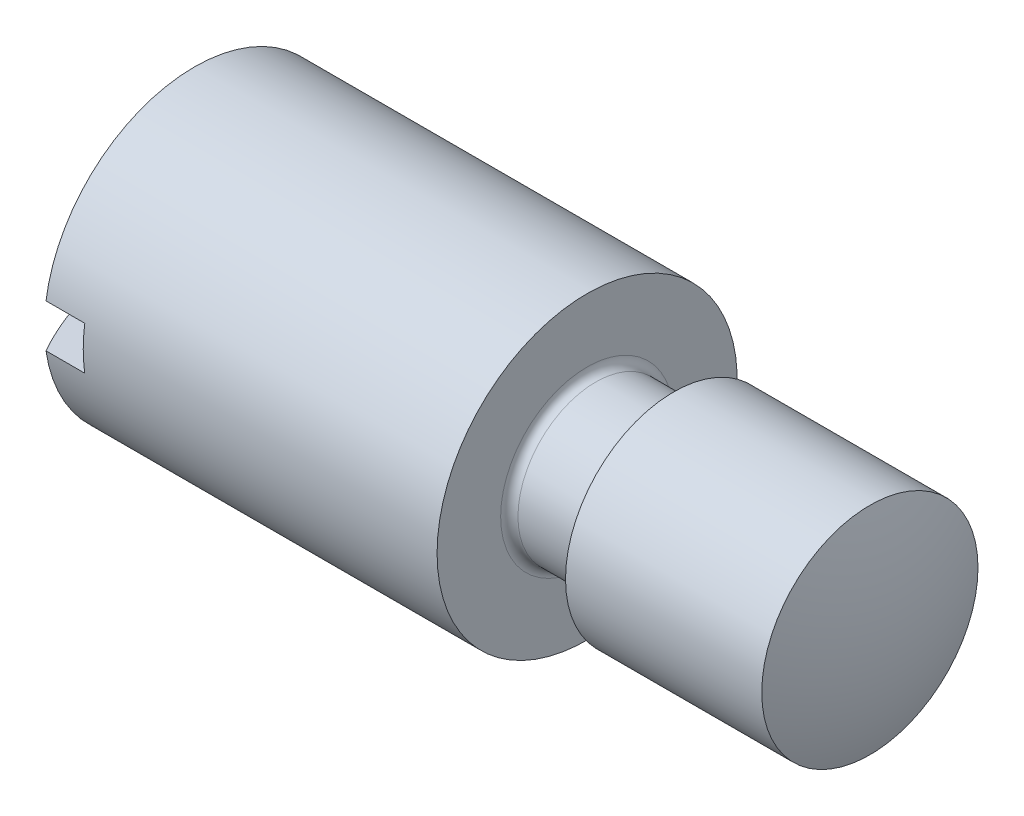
ISO-10303-21;
HEADER;
FILE_DESCRIPTION(('STEP AP214'),'2;1');
FILE_NAME('part.step','',(''),(''),'','','');
FILE_SCHEMA(('AUTOMOTIVE_DESIGN { 1 0 10303 214 1 1 1 1 }'));
ENDSEC;
DATA;
#1=APPLICATION_CONTEXT('core data for automotive mechanical design processes');
#2=APPLICATION_PROTOCOL_DEFINITION('international standard','automotive_design',2000,#1);
#3=PRODUCT_CONTEXT('',#1,'mechanical');
#4=PRODUCT('Part','Part','',(#3));
#5=PRODUCT_RELATED_PRODUCT_CATEGORY('part','',(#4));
#6=PRODUCT_DEFINITION_FORMATION('','',#4);
#7=PRODUCT_DEFINITION_CONTEXT('part definition',#1,'design');
#8=PRODUCT_DEFINITION('design','',#6,#7);
#9=PRODUCT_DEFINITION_SHAPE('','',#8);
#10=(LENGTH_UNIT() NAMED_UNIT(*) SI_UNIT(.MILLI.,.METRE.));
#11=(NAMED_UNIT(*) PLANE_ANGLE_UNIT() SI_UNIT($,.RADIAN.));
#12=(NAMED_UNIT(*) SI_UNIT($,.STERADIAN.) SOLID_ANGLE_UNIT());
#13=UNCERTAINTY_MEASURE_WITH_UNIT(LENGTH_MEASURE(1.E-05),#10,'distance_accuracy_value','');
#14=(GEOMETRIC_REPRESENTATION_CONTEXT(3) GLOBAL_UNCERTAINTY_ASSIGNED_CONTEXT((#13)) GLOBAL_UNIT_ASSIGNED_CONTEXT((#10,
#11,#12)) REPRESENTATION_CONTEXT('',''));
#15=CARTESIAN_POINT('',(0.,0.,0.));
#16=DIRECTION('',(0.,0.,1.));
#17=DIRECTION('',(1.,0.,0.));
#18=AXIS2_PLACEMENT_3D('',#15,#16,#17);
#19=CARTESIAN_POINT('',(3.5,0.,0.));
#20=DIRECTION('',(-1.,0.,0.));
#21=DIRECTION('',(0.,0.,-1.));
#22=AXIS2_PLACEMENT_3D('',#19,#20,#21);
#23=SPHERICAL_SURFACE('',#22,3.5);
#24=CARTESIAN_POINT('',(0.460300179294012,0.,0.));
#25=DIRECTION('',(-1.,0.,0.));
#26=DIRECTION('',(0.,0.,1.));
#27=AXIS2_PLACEMENT_3D('',#24,#25,#26);
#28=CIRCLE('',#27,1.735);
#29=CARTESIAN_POINT('',(0.460300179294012,-0.250000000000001,-1.71689399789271));
#30=VERTEX_POINT('',#29);
#31=CARTESIAN_POINT('',(0.460300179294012,-0.250000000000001,1.71689399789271));
#32=VERTEX_POINT('',#31);
#33=EDGE_CURVE('E118',#30,#32,#28,.T.);
#34=ORIENTED_EDGE('',*,*,#33,.T.);
#35=CARTESIAN_POINT('',(3.5,-0.250000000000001,0.));
#36=DIRECTION('',(0.,-1.,0.));
#37=DIRECTION('',(0.,0.,-1.));
#38=AXIS2_PLACEMENT_3D('',#35,#36,#37);
#39=CIRCLE('',#38,3.49106001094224);
#40=EDGE_CURVE('E60',#32,#30,#39,.T.);
#41=ORIENTED_EDGE('',*,*,#40,.T.);
#42=EDGE_LOOP('',(#34,#41));
#43=FACE_BOUND('',#42,.T.);
#44=ADVANCED_FACE('F37',(#43),#23,.T.);
#45=CARTESIAN_POINT('',(0.460300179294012,0.249999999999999,1.71689399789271));
#46=VERTEX_POINT('',#45);
#47=CARTESIAN_POINT('',(0.460300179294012,0.249999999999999,-1.71689399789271));
#48=VERTEX_POINT('',#47);
#49=EDGE_CURVE('E117',#46,#48,#28,.T.);
#50=ORIENTED_EDGE('',*,*,#49,.T.);
#51=CARTESIAN_POINT('',(3.5,0.249999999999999,0.));
#52=DIRECTION('',(0.,1.,0.));
#53=DIRECTION('',(0.,0.,1.));
#54=AXIS2_PLACEMENT_3D('',#51,#52,#53);
#55=CIRCLE('',#54,3.49106001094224);
#56=EDGE_CURVE('E84',#48,#46,#55,.T.);
#57=ORIENTED_EDGE('',*,*,#56,.T.);
#58=EDGE_LOOP('',(#50,#57));
#59=FACE_BOUND('',#58,.T.);
#60=ADVANCED_FACE('F126',(#59),#23,.T.);
#61=CARTESIAN_POINT('',(5.,0.,0.));
#62=DIRECTION('',(-1.,0.,0.));
#63=DIRECTION('',(0.,0.,-1.));
#64=AXIS2_PLACEMENT_3D('',#61,#62,#63);
#65=SPHERICAL_SURFACE('',#64,3.5);
#66=CARTESIAN_POINT('',(8.2691742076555,0.,0.));
#67=DIRECTION('',(-1.,0.,0.));
#68=DIRECTION('',(0.,0.,1.));
#69=AXIS2_PLACEMENT_3D('',#66,#67,#68);
#70=CIRCLE('',#69,1.25);
#71=CARTESIAN_POINT('',(8.2691742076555,0.,1.25));
#72=VERTEX_POINT('',#71);
#73=EDGE_CURVE('E105',#72,#72,#70,.T.);
#74=ORIENTED_EDGE('',*,*,#73,.F.);
#75=EDGE_LOOP('',(#74));
#76=FACE_BOUND('',#75,.T.);
#77=ADVANCED_FACE('F131',(#76),#65,.T.);
#78=CARTESIAN_POINT('',(-4.49873518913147,0.,0.));
#79=DIRECTION('',(-1.,0.,0.));
#80=DIRECTION('',(0.,0.,1.));
#81=AXIS2_PLACEMENT_3D('',#78,#79,#80);
#82=CYLINDRICAL_SURFACE('',#81,1.25);
#83=CARTESIAN_POINT('',(6.,0.,0.));
#84=DIRECTION('',(-1.,0.,0.));
#85=DIRECTION('',(0.,0.,1.));
#86=AXIS2_PLACEMENT_3D('',#83,#84,#85);
#87=CIRCLE('',#86,1.25);
#88=CARTESIAN_POINT('',(6.,0.,1.25));
#89=VERTEX_POINT('',#88);
#90=EDGE_CURVE('E107',#89,#89,#87,.T.);
#91=ORIENTED_EDGE('',*,*,#90,.F.);
#92=EDGE_LOOP('',(#91));
#93=FACE_BOUND('',#92,.T.);
#94=ORIENTED_EDGE('',*,*,#73,.T.);
#95=EDGE_LOOP('',(#94));
#96=FACE_BOUND('',#95,.T.);
#97=ADVANCED_FACE('F179',(#93,#96),#82,.T.);
#98=CARTESIAN_POINT('',(6.,0.,-1.25));
#99=DIRECTION('',(1.,0.,0.));
#100=DIRECTION('',(0.,0.,-1.));
#101=AXIS2_PLACEMENT_3D('',#98,#99,#100);
#102=PLANE('',#101);
#103=CARTESIAN_POINT('',(6.,0.,0.));
#104=DIRECTION('',(1.,0.,0.));
#105=DIRECTION('',(0.,0.,-1.));
#106=AXIS2_PLACEMENT_3D('',#103,#104,#105);
#107=CIRCLE('',#106,1.);
#108=CARTESIAN_POINT('',(6.,0.,-1.));
#109=VERTEX_POINT('',#108);
#110=EDGE_CURVE('E45',#109,#109,#107,.T.);
#111=ORIENTED_EDGE('',*,*,#110,.T.);
#112=EDGE_LOOP('',(#111));
#113=FACE_BOUND('',#112,.T.);
#114=ORIENTED_EDGE('',*,*,#90,.T.);
#115=EDGE_LOOP('',(#114));
#116=FACE_BOUND('',#115,.T.);
#117=ADVANCED_FACE('F177',(#113,#116),#102,.F.);
#118=CARTESIAN_POINT('',(-4.49873518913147,0.,0.));
#119=DIRECTION('',(-1.,0.,0.));
#120=DIRECTION('',(0.,0.,1.));
#121=AXIS2_PLACEMENT_3D('',#118,#119,#120);
#122=CYLINDRICAL_SURFACE('',#121,0.9);
#123=CARTESIAN_POINT('',(5.9,0.,0.));
#124=DIRECTION('',(1.,0.,0.));
#125=DIRECTION('',(0.,0.,-1.));
#126=AXIS2_PLACEMENT_3D('',#123,#124,#125);
#127=CIRCLE('',#126,0.9);
#128=CARTESIAN_POINT('',(5.9,0.,-0.9));
#129=VERTEX_POINT('',#128);
#130=EDGE_CURVE('E149',#129,#129,#127,.F.);
#131=ORIENTED_EDGE('',*,*,#130,.T.);
#132=EDGE_LOOP('',(#131));
#133=FACE_BOUND('',#132,.T.);
#134=CARTESIAN_POINT('',(5.1,0.,0.));
#135=DIRECTION('',(-1.,0.,0.));
#136=DIRECTION('',(0.,0.,1.));
#137=AXIS2_PLACEMENT_3D('',#134,#135,#136);
#138=CIRCLE('',#137,0.9);
#139=CARTESIAN_POINT('',(5.1,0.,0.9));
#140=VERTEX_POINT('',#139);
#141=EDGE_CURVE('E151',#140,#140,#138,.F.);
#142=ORIENTED_EDGE('',*,*,#141,.T.);
#143=EDGE_LOOP('',(#142));
#144=FACE_BOUND('',#143,.T.);
#145=ADVANCED_FACE('F159',(#133,#144),#122,.T.);
#146=CARTESIAN_POINT('',(5.,0.,-0.9));
#147=DIRECTION('',(-1.,0.,0.));
#148=DIRECTION('',(0.,0.,1.));
#149=AXIS2_PLACEMENT_3D('',#146,#147,#148);
#150=PLANE('',#149);
#151=CARTESIAN_POINT('',(5.,0.,0.));
#152=DIRECTION('',(-1.,0.,0.));
#153=DIRECTION('',(0.,0.,1.));
#154=AXIS2_PLACEMENT_3D('',#151,#152,#153);
#155=CIRCLE('',#154,1.);
#156=CARTESIAN_POINT('',(5.,0.,1.));
#157=VERTEX_POINT('',#156);
#158=EDGE_CURVE('E11',#157,#157,#155,.T.);
#159=ORIENTED_EDGE('',*,*,#158,.T.);
#160=EDGE_LOOP('',(#159));
#161=FACE_BOUND('',#160,.T.);
#162=CARTESIAN_POINT('',(5.,0.,0.));
#163=DIRECTION('',(-1.,0.,0.));
#164=DIRECTION('',(0.,0.,1.));
#165=AXIS2_PLACEMENT_3D('',#162,#163,#164);
#166=CIRCLE('',#165,1.735);
#167=CARTESIAN_POINT('',(5.,0.,1.735));
#168=VERTEX_POINT('',#167);
#169=EDGE_CURVE('E111',#168,#168,#166,.T.);
#170=ORIENTED_EDGE('',*,*,#169,.F.);
#171=EDGE_LOOP('',(#170));
#172=FACE_BOUND('',#171,.T.);
#173=ADVANCED_FACE('F163',(#161,#172),#150,.F.);
#174=CARTESIAN_POINT('',(-4.49873518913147,0.,0.));
#175=DIRECTION('',(-1.,0.,0.));
#176=DIRECTION('',(0.,0.,1.));
#177=AXIS2_PLACEMENT_3D('',#174,#175,#176);
#178=CYLINDRICAL_SURFACE('',#177,1.735);
#179=DIRECTION('',(-1.,0.,0.));
#180=VECTOR('',#179,1.);
#181=CARTESIAN_POINT('',(-4.49873518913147,-0.250000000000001,-1.71689399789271));
#182=LINE('',#181,#180);
#183=CARTESIAN_POINT('',(0.90893985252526,-0.250000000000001,-1.71689399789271));
#184=VERTEX_POINT('',#183);
#185=EDGE_CURVE('E100',#30,#184,#182,.F.);
#186=ORIENTED_EDGE('',*,*,#185,.T.);
#187=CARTESIAN_POINT('',(0.90893985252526,0.,0.));
#188=DIRECTION('',(1.,0.,0.));
#189=DIRECTION('',(0.,1.,0.));
#190=AXIS2_PLACEMENT_3D('',#187,#188,#189);
#191=CIRCLE('',#190,1.735);
#192=CARTESIAN_POINT('',(0.90893985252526,0.249999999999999,-1.71689399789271));
#193=VERTEX_POINT('',#192);
#194=EDGE_CURVE('E90',#184,#193,#191,.T.);
#195=ORIENTED_EDGE('',*,*,#194,.T.);
#196=DIRECTION('',(-1.,0.,0.));
#197=VECTOR('',#196,1.);
#198=CARTESIAN_POINT('',(-4.49873518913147,0.249999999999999,-1.71689399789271));
#199=LINE('',#198,#197);
#200=EDGE_CURVE('E79',#193,#48,#199,.T.);
#201=ORIENTED_EDGE('',*,*,#200,.T.);
#202=ORIENTED_EDGE('',*,*,#49,.F.);
#203=DIRECTION('',(-1.,0.,0.));
#204=VECTOR('',#203,1.);
#205=CARTESIAN_POINT('',(-4.49873518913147,0.249999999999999,1.71689399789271));
#206=LINE('',#205,#204);
#207=CARTESIAN_POINT('',(0.90893985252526,0.249999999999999,1.71689399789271));
#208=VERTEX_POINT('',#207);
#209=EDGE_CURVE('E89',#46,#208,#206,.F.);
#210=ORIENTED_EDGE('',*,*,#209,.T.);
#211=CARTESIAN_POINT('',(0.90893985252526,-0.250000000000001,1.71689399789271));
#212=VERTEX_POINT('',#211);
#213=EDGE_CURVE('E52',#208,#212,#191,.T.);
#214=ORIENTED_EDGE('',*,*,#213,.T.);
#215=DIRECTION('',(-1.,0.,0.));
#216=VECTOR('',#215,1.);
#217=CARTESIAN_POINT('',(-4.49873518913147,-0.250000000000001,1.71689399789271));
#218=LINE('',#217,#216);
#219=EDGE_CURVE('E101',#212,#32,#218,.T.);
#220=ORIENTED_EDGE('',*,*,#219,.T.);
#221=ORIENTED_EDGE('',*,*,#33,.F.);
#222=EDGE_LOOP('',(#186,#195,#201,#202,#210,#214,#220,#221));
#223=FACE_BOUND('',#222,.T.);
#224=ORIENTED_EDGE('',*,*,#169,.T.);
#225=EDGE_LOOP('',(#224));
#226=FACE_BOUND('',#225,.T.);
#227=ADVANCED_FACE('F97',(#223,#226),#178,.T.);
#228=CARTESIAN_POINT('',(0.90893985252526,0.249999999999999,-1.735));
#229=DIRECTION('',(1.,0.,0.));
#230=DIRECTION('',(0.,1.,0.));
#231=AXIS2_PLACEMENT_3D('',#228,#229,#230);
#232=PLANE('',#231);
#233=DIRECTION('',(0.,0.,1.));
#234=VECTOR('',#233,1.);
#235=CARTESIAN_POINT('',(0.90893985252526,0.249999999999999,-1.735));
#236=LINE('',#235,#234);
#237=EDGE_CURVE('E82',#193,#208,#236,.T.);
#238=ORIENTED_EDGE('',*,*,#237,.F.);
#239=ORIENTED_EDGE('',*,*,#194,.F.);
#240=DIRECTION('',(0.,0.,1.));
#241=VECTOR('',#240,1.);
#242=CARTESIAN_POINT('',(0.90893985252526,-0.250000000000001,-1.735));
#243=LINE('',#242,#241);
#244=EDGE_CURVE('E94',#184,#212,#243,.T.);
#245=ORIENTED_EDGE('',*,*,#244,.T.);
#246=ORIENTED_EDGE('',*,*,#213,.F.);
#247=EDGE_LOOP('',(#238,#239,#245,#246));
#248=FACE_BOUND('',#247,.T.);
#249=ADVANCED_FACE('F92',(#248),#232,.F.);
#250=CARTESIAN_POINT('',(0.90893985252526,-0.250000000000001,-1.735));
#251=DIRECTION('',(0.,-1.,0.));
#252=DIRECTION('',(0.,0.,-1.));
#253=AXIS2_PLACEMENT_3D('',#250,#251,#252);
#254=PLANE('',#253);
#255=ORIENTED_EDGE('',*,*,#244,.F.);
#256=ORIENTED_EDGE('',*,*,#185,.F.);
#257=ORIENTED_EDGE('',*,*,#40,.F.);
#258=ORIENTED_EDGE('',*,*,#219,.F.);
#259=EDGE_LOOP('',(#255,#256,#257,#258));
#260=FACE_BOUND('',#259,.T.);
#261=ADVANCED_FACE('F123',(#260),#254,.F.);
#262=CARTESIAN_POINT('',(0.90893985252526,0.249999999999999,-1.735));
#263=DIRECTION('',(0.,1.,0.));
#264=DIRECTION('',(0.,0.,1.));
#265=AXIS2_PLACEMENT_3D('',#262,#263,#264);
#266=PLANE('',#265);
#267=ORIENTED_EDGE('',*,*,#237,.T.);
#268=ORIENTED_EDGE('',*,*,#209,.F.);
#269=ORIENTED_EDGE('',*,*,#56,.F.);
#270=ORIENTED_EDGE('',*,*,#200,.F.);
#271=EDGE_LOOP('',(#267,#268,#269,#270));
#272=FACE_BOUND('',#271,.T.);
#273=ADVANCED_FACE('F80',(#272),#266,.F.);
#274=CARTESIAN_POINT('',(5.9,0.,0.));
#275=DIRECTION('',(1.,0.,0.));
#276=DIRECTION('',(0.,0.,-1.));
#277=AXIS2_PLACEMENT_3D('',#274,#275,#276);
#278=TOROIDAL_SURFACE('',#277,1.,0.1);
#279=ORIENTED_EDGE('',*,*,#110,.F.);
#280=EDGE_LOOP('',(#279));
#281=FACE_BOUND('',#280,.T.);
#282=ORIENTED_EDGE('',*,*,#130,.F.);
#283=EDGE_LOOP('',(#282));
#284=FACE_BOUND('',#283,.T.);
#285=ADVANCED_FACE('F135',(#281,#284),#278,.F.);
#286=CARTESIAN_POINT('',(5.1,0.,0.));
#287=DIRECTION('',(-1.,0.,0.));
#288=DIRECTION('',(0.,0.,1.));
#289=AXIS2_PLACEMENT_3D('',#286,#287,#288);
#290=TOROIDAL_SURFACE('',#289,1.,0.1);
#291=ORIENTED_EDGE('',*,*,#141,.F.);
#292=EDGE_LOOP('',(#291));
#293=FACE_BOUND('',#292,.T.);
#294=ORIENTED_EDGE('',*,*,#158,.F.);
#295=EDGE_LOOP('',(#294));
#296=FACE_BOUND('',#295,.T.);
#297=ADVANCED_FACE('F39',(#293,#296),#290,.F.);
#298=CLOSED_SHELL('',(#44,#60,#77,#97,#117,#145,#173,#227,#249,#261,#273,#285,#297));
#299=MANIFOLD_SOLID_BREP('B2',#298);
#300=ADVANCED_BREP_SHAPE_REPRESENTATION('',(#18,#299),#14);
#301=SHAPE_DEFINITION_REPRESENTATION(#9,#300);
ENDSEC;
END-ISO-10303-21;
